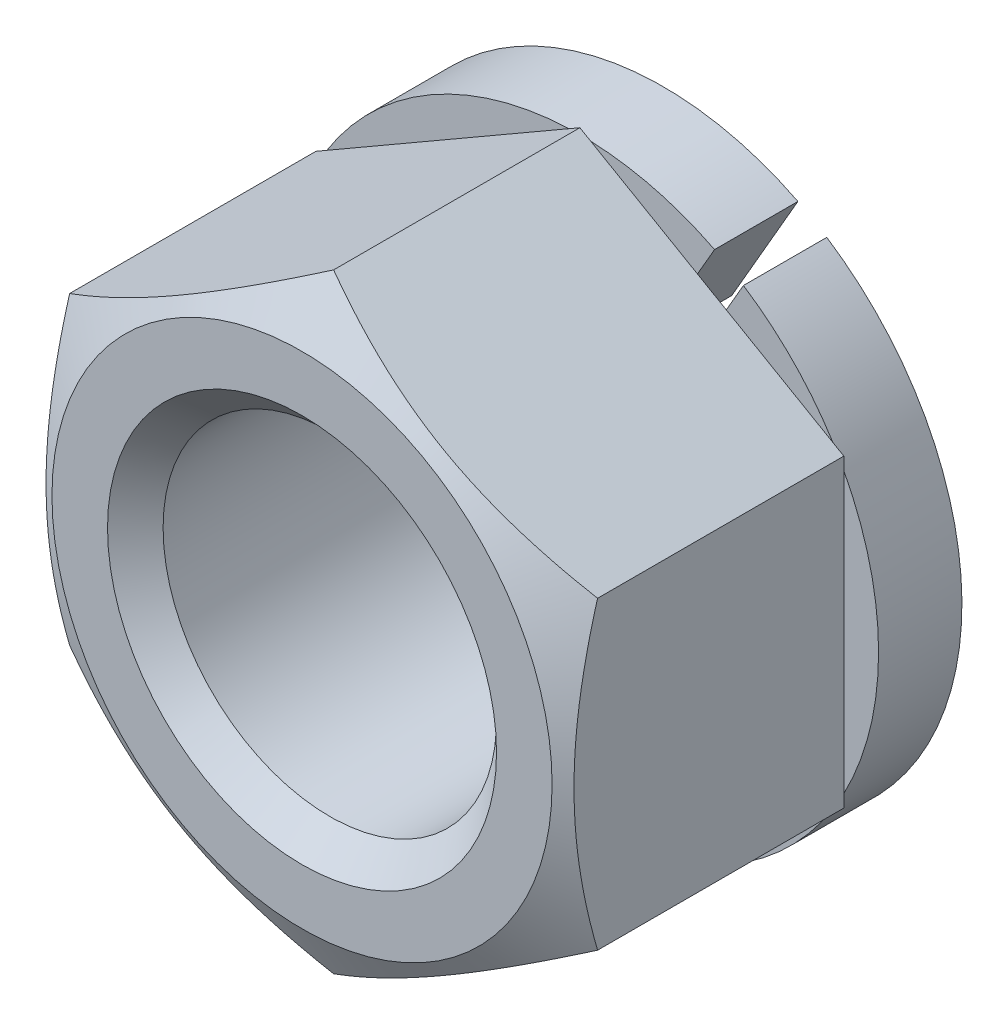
ISO-10303-21;
HEADER;
FILE_DESCRIPTION(('STEP AP214'),'2;1');
FILE_NAME('part.step','',(''),(''),'','','');
FILE_SCHEMA(('AUTOMOTIVE_DESIGN { 1 0 10303 214 1 1 1 1 }'));
ENDSEC;
DATA;
#1=APPLICATION_CONTEXT('core data for automotive mechanical design processes');
#2=APPLICATION_PROTOCOL_DEFINITION('international standard','automotive_design',2000,#1);
#3=PRODUCT_CONTEXT('',#1,'mechanical');
#4=PRODUCT('Part','Part','',(#3));
#5=PRODUCT_RELATED_PRODUCT_CATEGORY('part','',(#4));
#6=PRODUCT_DEFINITION_FORMATION('','',#4);
#7=PRODUCT_DEFINITION_CONTEXT('part definition',#1,'design');
#8=PRODUCT_DEFINITION('design','',#6,#7);
#9=PRODUCT_DEFINITION_SHAPE('','',#8);
#10=(LENGTH_UNIT() NAMED_UNIT(*) SI_UNIT(.MILLI.,.METRE.));
#11=(NAMED_UNIT(*) PLANE_ANGLE_UNIT() SI_UNIT($,.RADIAN.));
#12=(NAMED_UNIT(*) SI_UNIT($,.STERADIAN.) SOLID_ANGLE_UNIT());
#13=UNCERTAINTY_MEASURE_WITH_UNIT(LENGTH_MEASURE(1.E-05),#10,'distance_accuracy_value','');
#14=(GEOMETRIC_REPRESENTATION_CONTEXT(3) GLOBAL_UNCERTAINTY_ASSIGNED_CONTEXT((#13)) GLOBAL_UNIT_ASSIGNED_CONTEXT((#10,
#11,#12)) REPRESENTATION_CONTEXT('',''));
#15=CARTESIAN_POINT('',(0.,0.,0.));
#16=DIRECTION('',(0.,0.,1.));
#17=DIRECTION('',(1.,0.,0.));
#18=AXIS2_PLACEMENT_3D('',#15,#16,#17);
#19=CARTESIAN_POINT('',(0.,0.,0.));
#20=DIRECTION('',(0.,0.,-1.));
#21=DIRECTION('',(-1.,0.,0.));
#22=AXIS2_PLACEMENT_3D('',#19,#20,#21);
#23=PLANE('',#22);
#24=CARTESIAN_POINT('',(0.,0.,0.));
#25=DIRECTION('',(0.,0.,-1.));
#26=DIRECTION('',(-1.,0.,0.));
#27=AXIS2_PLACEMENT_3D('',#24,#25,#26);
#28=CIRCLE('',#27,10.75);
#29=CARTESIAN_POINT('',(5.88623661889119,8.9952608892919,0.));
#30=VERTEX_POINT('',#29);
#31=CARTESIAN_POINT('',(9.10710626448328,5.71166486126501,0.));
#32=VERTEX_POINT('',#31);
#33=EDGE_CURVE('E178',#30,#32,#28,.T.);
#34=ORIENTED_EDGE('',*,*,#33,.F.);
#35=DIRECTION('',(-0.5,-0.866025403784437,0.));
#36=VECTOR('',#35,1.);
#37=CARTESIAN_POINT('',(3.50457755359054,4.87010638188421,0.));
#38=LINE('',#37,#36);
#39=CARTESIAN_POINT('',(5.26961524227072,7.9272413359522,0.));
#40=VERTEX_POINT('',#39);
#41=EDGE_CURVE('E157',#30,#40,#38,.T.);
#42=ORIENTED_EDGE('',*,*,#41,.T.);
#43=DIRECTION('',(-0.866025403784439,0.5,0.));
#44=VECTOR('',#43,1.);
#45=CARTESIAN_POINT('',(9.5,5.48482755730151,0.));
#46=LINE('',#45,#44);
#47=EDGE_CURVE('E370',#32,#40,#46,.T.);
#48=ORIENTED_EDGE('',*,*,#47,.F.);
#49=EDGE_LOOP('',(#34,#42,#48));
#50=FACE_BOUND('',#49,.T.);
#51=ADVANCED_FACE('F14',(#50),#23,.F.);
#52=CARTESIAN_POINT('',(-19.,0.,0.));
#53=DIRECTION('',(0.,0.,-1.));
#54=DIRECTION('',(-1.,0.,0.));
#55=AXIS2_PLACEMENT_3D('',#52,#53,#54);
#56=PLANE('',#55);
#57=CARTESIAN_POINT('',(-9.5,5.03115294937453,0.));
#58=VERTEX_POINT('',#57);
#59=CARTESIAN_POINT('',(-9.10710626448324,5.71166486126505,0.));
#60=VERTEX_POINT('',#59);
#61=EDGE_CURVE('E174',#58,#60,#28,.T.);
#62=ORIENTED_EDGE('',*,*,#61,.F.);
#63=DIRECTION('',(0.,-1.,0.));
#64=VECTOR('',#63,1.);
#65=CARTESIAN_POINT('',(-9.5,5.48482755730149,0.));
#66=LINE('',#65,#64);
#67=CARTESIAN_POINT('',(-9.5,5.48482755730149,0.));
#68=VERTEX_POINT('',#67);
#69=EDGE_CURVE('E358',#68,#58,#66,.T.);
#70=ORIENTED_EDGE('',*,*,#69,.F.);
#71=DIRECTION('',(-0.866025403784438,-0.5,0.));
#72=VECTOR('',#71,1.);
#73=CARTESIAN_POINT('',(0.,10.969655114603,0.));
#74=LINE('',#73,#72);
#75=EDGE_CURVE('E367',#60,#68,#74,.T.);
#76=ORIENTED_EDGE('',*,*,#75,.F.);
#77=EDGE_LOOP('',(#62,#70,#76));
#78=FACE_BOUND('',#77,.T.);
#79=ADVANCED_FACE('F263',(#78),#56,.T.);
#80=CARTESIAN_POINT('',(-0.392893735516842,10.7428178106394,0.));
#81=VERTEX_POINT('',#80);
#82=CARTESIAN_POINT('',(0.392893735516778,10.7428178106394,0.));
#83=VERTEX_POINT('',#82);
#84=EDGE_CURVE('E326',#81,#83,#28,.T.);
#85=ORIENTED_EDGE('',*,*,#84,.F.);
#86=CARTESIAN_POINT('',(0.,10.969655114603,0.));
#87=VERTEX_POINT('',#86);
#88=EDGE_CURVE('E363',#87,#81,#74,.T.);
#89=ORIENTED_EDGE('',*,*,#88,.F.);
#90=EDGE_CURVE('E373',#83,#87,#46,.T.);
#91=ORIENTED_EDGE('',*,*,#90,.F.);
#92=EDGE_LOOP('',(#85,#89,#91));
#93=FACE_BOUND('',#92,.T.);
#94=ADVANCED_FACE('F273',(#93),#56,.T.);
#95=CARTESIAN_POINT('',(9.5,5.03115294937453,0.));
#96=VERTEX_POINT('',#95);
#97=EDGE_CURVE('E318',#32,#96,#28,.T.);
#98=ORIENTED_EDGE('',*,*,#97,.F.);
#99=CARTESIAN_POINT('',(9.5,5.48482755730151,0.));
#100=VERTEX_POINT('',#99);
#101=EDGE_CURVE('E368',#100,#32,#46,.T.);
#102=ORIENTED_EDGE('',*,*,#101,.F.);
#103=DIRECTION('',(0.,1.,0.));
#104=VECTOR('',#103,1.);
#105=CARTESIAN_POINT('',(9.5,-5.48482755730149,0.));
#106=LINE('',#105,#104);
#107=EDGE_CURVE('E311',#96,#100,#106,.T.);
#108=ORIENTED_EDGE('',*,*,#107,.F.);
#109=EDGE_LOOP('',(#98,#102,#108));
#110=FACE_BOUND('',#109,.T.);
#111=ADVANCED_FACE('F488',(#110),#56,.T.);
#112=CARTESIAN_POINT('',(9.5,-5.03115294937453,0.));
#113=VERTEX_POINT('',#112);
#114=CARTESIAN_POINT('',(9.10710626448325,-5.71166486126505,0.));
#115=VERTEX_POINT('',#114);
#116=EDGE_CURVE('E316',#113,#115,#28,.T.);
#117=ORIENTED_EDGE('',*,*,#116,.F.);
#118=CARTESIAN_POINT('',(9.5,-5.48482755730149,0.));
#119=VERTEX_POINT('',#118);
#120=EDGE_CURVE('E310',#119,#113,#106,.T.);
#121=ORIENTED_EDGE('',*,*,#120,.F.);
#122=DIRECTION('',(0.866025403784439,0.5,0.));
#123=VECTOR('',#122,1.);
#124=CARTESIAN_POINT('',(0.,-10.969655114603,0.));
#125=LINE('',#124,#123);
#126=EDGE_CURVE('E37',#115,#119,#125,.T.);
#127=ORIENTED_EDGE('',*,*,#126,.F.);
#128=EDGE_LOOP('',(#117,#121,#127));
#129=FACE_BOUND('',#128,.T.);
#130=ADVANCED_FACE('F495',(#129),#56,.T.);
#131=CARTESIAN_POINT('',(0.392893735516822,-10.7428178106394,0.));
#132=VERTEX_POINT('',#131);
#133=CARTESIAN_POINT('',(-0.392893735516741,-10.7428178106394,0.));
#134=VERTEX_POINT('',#133);
#135=EDGE_CURVE('E329',#132,#134,#28,.T.);
#136=ORIENTED_EDGE('',*,*,#135,.F.);
#137=CARTESIAN_POINT('',(0.,-10.969655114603,0.));
#138=VERTEX_POINT('',#137);
#139=EDGE_CURVE('E374',#138,#132,#125,.T.);
#140=ORIENTED_EDGE('',*,*,#139,.F.);
#141=DIRECTION('',(0.866025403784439,-0.5,0.));
#142=VECTOR('',#141,1.);
#143=CARTESIAN_POINT('',(-9.5,-5.48482755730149,0.));
#144=LINE('',#143,#142);
#145=EDGE_CURVE('E379',#134,#138,#144,.T.);
#146=ORIENTED_EDGE('',*,*,#145,.F.);
#147=EDGE_LOOP('',(#136,#140,#146));
#148=FACE_BOUND('',#147,.T.);
#149=ADVANCED_FACE('F264',(#148),#56,.T.);
#150=CARTESIAN_POINT('',(-19.,0.,10.));
#151=DIRECTION('',(0.,0.,-1.));
#152=DIRECTION('',(-1.,0.,0.));
#153=AXIS2_PLACEMENT_3D('',#150,#151,#152);
#154=PLANE('',#153);
#155=CARTESIAN_POINT('',(0.,0.,10.));
#156=DIRECTION('',(0.,0.,-1.));
#157=DIRECTION('',(-1.,0.,0.));
#158=AXIS2_PLACEMENT_3D('',#155,#156,#157);
#159=CIRCLE('',#158,7.);
#160=CARTESIAN_POINT('',(-7.,0.,10.));
#161=VERTEX_POINT('',#160);
#162=EDGE_CURVE('E9',#161,#161,#159,.T.);
#163=ORIENTED_EDGE('',*,*,#162,.T.);
#164=EDGE_LOOP('',(#163));
#165=FACE_BOUND('',#164,.T.);
#166=CARTESIAN_POINT('',(0.,0.,10.));
#167=DIRECTION('',(0.,0.,-1.));
#168=DIRECTION('',(-1.,0.,0.));
#169=AXIS2_PLACEMENT_3D('',#166,#167,#168);
#170=CIRCLE('',#169,9.);
#171=CARTESIAN_POINT('',(-9.,0.,10.));
#172=VERTEX_POINT('',#171);
#173=EDGE_CURVE('E173',#172,#172,#170,.T.);
#174=ORIENTED_EDGE('',*,*,#173,.F.);
#175=EDGE_LOOP('',(#174));
#176=FACE_BOUND('',#175,.T.);
#177=ADVANCED_FACE('F260',(#165,#176),#154,.F.);
#178=CARTESIAN_POINT('',(-9.1071062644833,-5.71166486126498,0.));
#179=VERTEX_POINT('',#178);
#180=CARTESIAN_POINT('',(-9.5,-5.03115294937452,0.));
#181=VERTEX_POINT('',#180);
#182=EDGE_CURVE('E179',#179,#181,#28,.T.);
#183=ORIENTED_EDGE('',*,*,#182,.F.);
#184=CARTESIAN_POINT('',(-9.5,-5.48482755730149,0.));
#185=VERTEX_POINT('',#184);
#186=EDGE_CURVE('E376',#185,#179,#144,.T.);
#187=ORIENTED_EDGE('',*,*,#186,.F.);
#188=EDGE_CURVE('E362',#181,#185,#66,.T.);
#189=ORIENTED_EDGE('',*,*,#188,.F.);
#190=EDGE_LOOP('',(#183,#187,#189));
#191=FACE_BOUND('',#190,.T.);
#192=ADVANCED_FACE('F253',(#191),#56,.T.);
#193=CARTESIAN_POINT('',(-9.5,-5.48482755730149,10.));
#194=DIRECTION('',(0.5,0.866025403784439,0.));
#195=DIRECTION('',(-0.866025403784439,0.5,0.));
#196=AXIS2_PLACEMENT_3D('',#193,#194,#195);
#197=PLANE('',#196);
#198=DIRECTION('',(0.,0.,-1.));
#199=VECTOR('',#198,1.);
#200=CARTESIAN_POINT('',(0.,-10.969655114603,10.));
#201=LINE('',#200,#199);
#202=CARTESIAN_POINT('',(0.,-10.969655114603,8.86281908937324));
#203=VERTEX_POINT('',#202);
#204=EDGE_CURVE('E335',#203,#138,#201,.T.);
#205=ORIENTED_EDGE('',*,*,#204,.F.);
#206=CARTESIAN_POINT('',(0.000199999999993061,-10.9697705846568,8.86275242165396));
#207=CARTESIAN_POINT('',(-0.208630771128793,-10.8492020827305,8.93235142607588));
#208=CARTESIAN_POINT('',(-0.418240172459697,-10.7281840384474,8.99879155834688));
#209=CARTESIAN_POINT('',(-0.839139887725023,-10.4851774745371,9.12447758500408));
#210=CARTESIAN_POINT('',(-1.05043073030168,-10.3631886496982,9.18372111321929));
#211=CARTESIAN_POINT('',(-1.68770779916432,-9.99525656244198,9.34951029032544));
#212=CARTESIAN_POINT('',(-2.11620976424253,-9.7478608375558,9.44381042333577));
#213=CARTESIAN_POINT('',(-2.75744333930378,-9.37764446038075,9.55438616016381));
#214=CARTESIAN_POINT('',(-2.9682592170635,-9.25592985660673,9.5858850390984));
#215=CARTESIAN_POINT('',(-3.39086703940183,-9.01193711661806,9.63870666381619));
#216=CARTESIAN_POINT('',(-3.60265900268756,-8.88965896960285,9.66002921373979));
#217=CARTESIAN_POINT('',(-4.02659621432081,-8.64489870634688,9.69195184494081));
#218=CARTESIAN_POINT('',(-4.23874074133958,-8.52241700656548,9.70256466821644));
#219=CARTESIAN_POINT('',(-4.66322575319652,-8.27734047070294,9.71284233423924));
#220=CARTESIAN_POINT('',(-4.8755662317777,-8.15474563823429,9.71250751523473));
#221=CARTESIAN_POINT('',(-5.27254199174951,-7.9255515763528,9.70165149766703));
#222=CARTESIAN_POINT('',(-5.45720529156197,-7.81893617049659,9.69245459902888));
#223=CARTESIAN_POINT('',(-5.82610000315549,-7.60595470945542,9.66595946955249));
#224=CARTESIAN_POINT('',(-6.01033138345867,-7.49958867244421,9.64866066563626));
#225=CARTESIAN_POINT('',(-6.56231167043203,-7.18090270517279,9.58502038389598));
#226=CARTESIAN_POINT('',(-6.92908353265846,-6.96914687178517,9.52694296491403));
#227=CARTESIAN_POINT('',(-7.66651782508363,-6.54338898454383,9.38174885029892));
#228=CARTESIAN_POINT('',(-8.03708614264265,-6.32944126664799,9.29401669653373));
#229=CARTESIAN_POINT('',(-8.77269671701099,-5.90473630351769,9.09490112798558));
#230=CARTESIAN_POINT('',(-9.13774839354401,-5.69397361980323,8.98356447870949));
#231=CARTESIAN_POINT('',(-9.5002,-5.48471208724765,8.86275242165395));
#232=B_SPLINE_CURVE_WITH_KNOTS('',3,(#206,#207,#208,#209,#210,#211,#212,#213,#214,#215,#216,
#217,#218,#219,#220,#221,#222,#223,#224,#225,#226,#227,#228,#229,#230,#231),.UNSPECIFIED.,.F.,
.F.,(4,2,2,2,2,2,2,2,2,2,2,2,4),(0.,0.752880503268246,1.50600787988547,3.01546870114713,
3.75167336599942,4.4878921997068,5.22323407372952,5.95855322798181,6.59868084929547,
7.23885375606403,8.52010929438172,9.82978009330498,11.1368800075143),.UNSPECIFIED.);
#233=CARTESIAN_POINT('',(-9.5,-5.48482755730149,8.86281908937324));
#234=VERTEX_POINT('',#233);
#235=EDGE_CURVE('E238',#203,#234,#232,.T.);
#236=ORIENTED_EDGE('',*,*,#235,.T.);
#237=DIRECTION('',(0.,0.,-1.));
#238=VECTOR('',#237,1.);
#239=CARTESIAN_POINT('',(-9.5,-5.48482755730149,10.));
#240=LINE('',#239,#238);
#241=EDGE_CURVE('E355',#234,#185,#240,.T.);
#242=ORIENTED_EDGE('',*,*,#241,.T.);
#243=ORIENTED_EDGE('',*,*,#186,.T.);
#244=EDGE_CURVE('E378',#179,#134,#144,.T.);
#245=ORIENTED_EDGE('',*,*,#244,.T.);
#246=ORIENTED_EDGE('',*,*,#145,.T.);
#247=EDGE_LOOP('',(#205,#236,#242,#243,#245,#246));
#248=FACE_BOUND('',#247,.T.);
#249=ADVANCED_FACE('F248',(#248),#197,.F.);
#250=CARTESIAN_POINT('',(0.,-10.969655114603,10.));
#251=DIRECTION('',(-0.5,0.866025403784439,0.));
#252=DIRECTION('',(-0.866025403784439,-0.5,0.));
#253=AXIS2_PLACEMENT_3D('',#250,#251,#252);
#254=PLANE('',#253);
#255=DIRECTION('',(0.,0.,-1.));
#256=VECTOR('',#255,1.);
#257=CARTESIAN_POINT('',(9.5,-5.48482755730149,10.));
#258=LINE('',#257,#256);
#259=CARTESIAN_POINT('',(9.5,-5.48482755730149,8.86281908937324));
#260=VERTEX_POINT('',#259);
#261=EDGE_CURVE('E341',#260,#119,#258,.T.);
#262=ORIENTED_EDGE('',*,*,#261,.F.);
#263=CARTESIAN_POINT('',(9.5002,-5.48471208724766,8.86275242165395));
#264=CARTESIAN_POINT('',(9.29136922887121,-5.60528058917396,8.93235142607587));
#265=CARTESIAN_POINT('',(9.08175982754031,-5.72629863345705,8.99879155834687));
#266=CARTESIAN_POINT('',(8.66086011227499,-5.96930519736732,9.12447758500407));
#267=CARTESIAN_POINT('',(8.44956926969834,-6.09129402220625,9.18372111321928));
#268=CARTESIAN_POINT('',(7.8122922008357,-6.45922610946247,9.34951029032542));
#269=CARTESIAN_POINT('',(7.3837902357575,-6.70662183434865,9.44381042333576));
#270=CARTESIAN_POINT('',(6.74255666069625,-7.07683821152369,9.5543861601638));
#271=CARTESIAN_POINT('',(6.53174078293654,-7.19855281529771,9.58588503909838));
#272=CARTESIAN_POINT('',(6.10913296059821,-7.44254555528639,9.63870666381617));
#273=CARTESIAN_POINT('',(5.89734099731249,-7.5648237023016,9.66002921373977));
#274=CARTESIAN_POINT('',(5.47340378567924,-7.80958396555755,9.69195184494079));
#275=CARTESIAN_POINT('',(5.26125925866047,-7.93206566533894,9.70256466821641));
#276=CARTESIAN_POINT('',(4.83677424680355,-8.1771422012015,9.71284233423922));
#277=CARTESIAN_POINT('',(4.62443376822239,-8.29973703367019,9.71250751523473));
#278=CARTESIAN_POINT('',(4.22745800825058,-8.52893109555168,9.70165149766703));
#279=CARTESIAN_POINT('',(4.04279470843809,-8.63554650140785,9.69245459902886));
#280=CARTESIAN_POINT('',(3.67389999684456,-8.848527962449,9.66595946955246));
#281=CARTESIAN_POINT('',(3.48966861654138,-8.95489399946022,9.64866066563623));
#282=CARTESIAN_POINT('',(2.93768832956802,-9.27357996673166,9.58502038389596));
#283=CARTESIAN_POINT('',(2.57091646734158,-9.48533580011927,9.52694296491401));
#284=CARTESIAN_POINT('',(1.8334821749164,-9.91109368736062,9.38174885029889));
#285=CARTESIAN_POINT('',(1.46291385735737,-10.1250414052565,9.2940166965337));
#286=CARTESIAN_POINT('',(0.72730328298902,-10.5497463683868,9.09490112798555));
#287=CARTESIAN_POINT('',(0.362251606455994,-10.7605090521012,8.98356447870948));
#288=CARTESIAN_POINT('',(-0.00020000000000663,-10.9697705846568,8.86275242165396));
#289=B_SPLINE_CURVE_WITH_KNOTS('',3,(#263,#264,#265,#266,#267,#268,#269,#270,#271,#272,#273,
#274,#275,#276,#277,#278,#279,#280,#281,#282,#283,#284,#285,#286,#287,#288),.UNSPECIFIED.,.F.,
.F.,(4,2,2,2,2,2,2,2,2,2,2,2,4),(0.,0.752880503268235,1.50600787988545,3.0154687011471,
3.75167336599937,4.48789219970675,5.22323407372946,5.95855322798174,6.5986808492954,
7.23885375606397,8.52010929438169,9.82978009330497,11.1368800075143),.UNSPECIFIED.);
#290=EDGE_CURVE('E231',#260,#203,#289,.T.);
#291=ORIENTED_EDGE('',*,*,#290,.T.);
#292=ORIENTED_EDGE('',*,*,#204,.T.);
#293=ORIENTED_EDGE('',*,*,#139,.T.);
#294=EDGE_CURVE('E375',#132,#115,#125,.T.);
#295=ORIENTED_EDGE('',*,*,#294,.T.);
#296=ORIENTED_EDGE('',*,*,#126,.T.);
#297=EDGE_LOOP('',(#262,#291,#292,#293,#295,#296));
#298=FACE_BOUND('',#297,.T.);
#299=ADVANCED_FACE('F244',(#298),#254,.F.);
#300=CARTESIAN_POINT('',(9.5,-5.48482755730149,10.));
#301=DIRECTION('',(-1.,0.,0.));
#302=DIRECTION('',(0.,0.,1.));
#303=AXIS2_PLACEMENT_3D('',#300,#301,#302);
#304=PLANE('',#303);
#305=DIRECTION('',(0.,0.,-1.));
#306=VECTOR('',#305,1.);
#307=CARTESIAN_POINT('',(9.5,5.48482755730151,10.));
#308=LINE('',#307,#306);
#309=CARTESIAN_POINT('',(9.5,5.48482755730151,8.86281908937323));
#310=VERTEX_POINT('',#309);
#311=EDGE_CURVE('E345',#310,#100,#308,.T.);
#312=ORIENTED_EDGE('',*,*,#311,.F.);
#313=CARTESIAN_POINT('',(9.5,-14.6148367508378,5.13229873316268));
#314=CARTESIAN_POINT('',(9.5,-14.4078646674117,5.23248573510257));
#315=CARTESIAN_POINT('',(9.5,-14.2006464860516,5.33216409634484));
#316=CARTESIAN_POINT('',(9.5,-13.7856665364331,5.53038809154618));
#317=CARTESIAN_POINT('',(9.5,-13.5779047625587,5.62893371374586));
#318=CARTESIAN_POINT('',(9.5,-12.9536699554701,5.92272506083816));
#319=CARTESIAN_POINT('',(9.5,-12.5363105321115,6.11609463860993));
#320=CARTESIAN_POINT('',(9.5,-11.6964302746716,6.49770516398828));
#321=CARTESIAN_POINT('',(9.5,-11.2738936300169,6.68591140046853));
#322=CARTESIAN_POINT('',(9.5,-10.4254186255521,7.05446510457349));
#323=CARTESIAN_POINT('',(9.5,-9.99948043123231,7.23481295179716));
#324=CARTESIAN_POINT('',(9.5,-9.13025376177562,7.5910039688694));
#325=CARTESIAN_POINT('',(9.5,-8.68683650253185,7.76653461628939));
#326=CARTESIAN_POINT('',(9.5,-7.79477203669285,8.1040230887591));
#327=CARTESIAN_POINT('',(9.5,-7.34612424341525,8.26597937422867));
#328=CARTESIAN_POINT('',(9.5,-6.44375804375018,8.57197988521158));
#329=CARTESIAN_POINT('',(9.5,-5.99005242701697,8.71606141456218));
#330=CARTESIAN_POINT('',(9.5,-5.0761514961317,8.9816137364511));
#331=CARTESIAN_POINT('',(9.5,-4.61595831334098,9.10309177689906));
#332=CARTESIAN_POINT('',(9.5,-3.69126680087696,9.31688415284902));
#333=CARTESIAN_POINT('',(9.5,-3.22680487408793,9.40935163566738));
#334=CARTESIAN_POINT('',(9.5,-2.52597866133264,9.52223165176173));
#335=CARTESIAN_POINT('',(9.5,-2.29166293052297,9.55555635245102));
#336=CARTESIAN_POINT('',(9.5,-1.82190740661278,9.61294252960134));
#337=CARTESIAN_POINT('',(9.5,-1.58646772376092,9.63700489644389));
#338=CARTESIAN_POINT('',(9.5,-1.11780333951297,9.67509126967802));
#339=CARTESIAN_POINT('',(9.5,-0.88458878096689,9.68923962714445));
#340=CARTESIAN_POINT('',(9.5,-0.417770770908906,9.70767011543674));
#341=CARTESIAN_POINT('',(9.5,-0.184167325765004,9.71195240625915));
#342=CARTESIAN_POINT('',(9.5,0.283012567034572,9.71054887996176));
#343=CARTESIAN_POINT('',(9.5,0.516589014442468,9.70486297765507));
#344=CARTESIAN_POINT('',(9.5,0.983298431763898,9.68365975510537));
#345=CARTESIAN_POINT('',(9.5,1.21643137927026,9.66814195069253));
#346=CARTESIAN_POINT('',(9.5,1.7803409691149,9.61904041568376));
#347=CARTESIAN_POINT('',(9.5,2.11070112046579,9.58059110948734));
#348=CARTESIAN_POINT('',(9.5,2.76889307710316,9.48607262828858));
#349=CARTESIAN_POINT('',(9.5,3.09672451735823,9.43000095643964));
#350=CARTESIAN_POINT('',(9.5,3.74957265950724,9.30223263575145));
#351=CARTESIAN_POINT('',(9.5,4.07458688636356,9.23052346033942));
#352=CARTESIAN_POINT('',(9.5,4.72131812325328,9.07366125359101));
#353=CARTESIAN_POINT('',(9.5,5.04303519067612,8.98850845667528));
#354=CARTESIAN_POINT('',(9.5,5.69019022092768,8.80482698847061));
#355=CARTESIAN_POINT('',(9.5,6.015556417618,8.70604720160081));
#356=CARTESIAN_POINT('',(9.5,6.66308248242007,8.49853754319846));
#357=CARTESIAN_POINT('',(9.5,6.98524232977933,8.38980760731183));
#358=CARTESIAN_POINT('',(9.5,7.62651950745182,8.16410157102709));
#359=CARTESIAN_POINT('',(9.5,7.94563786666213,8.04712838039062));
#360=CARTESIAN_POINT('',(9.5,8.58124736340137,7.80628683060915));
#361=CARTESIAN_POINT('',(9.5,8.89773852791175,7.68241854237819));
#362=CARTESIAN_POINT('',(9.5,9.62876672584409,7.38859225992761));
#363=CARTESIAN_POINT('',(9.5,10.0424495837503,7.21651263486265));
#364=CARTESIAN_POINT('',(9.5,10.8664391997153,6.8644298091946));
#365=CARTESIAN_POINT('',(9.5,11.2767457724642,6.68442617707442));
#366=CARTESIAN_POINT('',(9.5,12.0945919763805,6.31804036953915));
#367=CARTESIAN_POINT('',(9.5,12.5021310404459,6.1316569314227));
#368=CARTESIAN_POINT('',(9.5,13.3148099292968,5.75376233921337));
#369=CARTESIAN_POINT('',(9.5,13.7199497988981,5.5622512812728));
#370=CARTESIAN_POINT('',(9.5,14.5286246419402,5.17484256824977));
#371=CARTESIAN_POINT('',(9.5,14.9321575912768,4.97894069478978));
#372=CARTESIAN_POINT('',(9.5,15.7375188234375,4.58366538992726));
#373=CARTESIAN_POINT('',(9.5,16.1393470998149,4.38429194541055));
#374=CARTESIAN_POINT('',(9.5,17.3425803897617,3.78191090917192));
#375=CARTESIAN_POINT('',(9.5,18.14182917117,3.37459659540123));
#376=CARTESIAN_POINT('',(9.5,19.6719598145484,2.58493178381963));
#377=CARTESIAN_POINT('',(9.5,20.4031675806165,2.20321005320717));
#378=CARTESIAN_POINT('',(9.5,21.8628625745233,1.43454810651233));
#379=CARTESIAN_POINT('',(9.5,22.5913497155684,1.04760772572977));
#380=CARTESIAN_POINT('',(9.5,24.0445088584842,0.270634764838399));
#381=CARTESIAN_POINT('',(9.5,24.7691857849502,-0.119388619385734));
#382=CARTESIAN_POINT('',(9.5,26.2167909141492,-0.90258046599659));
#383=CARTESIAN_POINT('',(9.5,26.9397192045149,-1.29574876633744));
#384=CARTESIAN_POINT('',(9.5,27.6619992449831,-1.69009644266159));
#385=B_SPLINE_CURVE_WITH_KNOTS('',3,(#313,#314,#315,#316,#317,#318,#319,#320,#321,#322,#323,
#324,#325,#326,#327,#328,#329,#330,#331,#332,#333,#334,#335,#336,#337,#338,#339,#340,#341,#342,
#343,#344,#345,#346,#347,#348,#349,#350,#351,#352,#353,#354,#355,#356,#357,#358,#359,#360,#361,
#362,#363,#364,#365,#366,#367,#368,#369,#370,#371,#372,#373,#374,#375,#376,#377,#378,#379,#380,
#381,#382,#383,#384),.UNSPECIFIED.,.F.,.F.,(4,2,2,2,2,2,2,2,2,2,2,2,2,2,2,2,2,2,2,2,2,2,2,2,2,2,
2,2,2,2,2,2,2,2,2,4),(0.,0.68983486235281,1.37967687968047,2.75957131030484,4.14717928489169,
5.53472015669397,6.96523614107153,8.39591415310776,9.82355429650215,11.2507358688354,
12.6702513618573,13.3801178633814,14.089916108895,14.790643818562,15.4913601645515,
16.1920824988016,16.8928393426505,17.8900552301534,18.8874124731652,19.8855716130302,
20.8837133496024,21.9036134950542,22.9235202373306,23.9430687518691,24.9626067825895,
26.3066332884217,27.6507330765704,28.9951004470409,30.3394426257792,31.6851369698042,
33.0308363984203,35.7219177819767,38.1964429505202,40.6710463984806,43.1399395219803,
45.6087062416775),.UNSPECIFIED.);
#386=EDGE_CURVE('E224',#310,#260,#385,.F.);
#387=ORIENTED_EDGE('',*,*,#386,.T.);
#388=ORIENTED_EDGE('',*,*,#261,.T.);
#389=ORIENTED_EDGE('',*,*,#120,.T.);
#390=EDGE_CURVE('E304',#113,#96,#106,.T.);
#391=ORIENTED_EDGE('',*,*,#390,.T.);
#392=ORIENTED_EDGE('',*,*,#107,.T.);
#393=EDGE_LOOP('',(#312,#387,#388,#389,#391,#392));
#394=FACE_BOUND('',#393,.T.);
#395=ADVANCED_FACE('F247',(#394),#304,.F.);
#396=CARTESIAN_POINT('',(9.5,5.48482755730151,10.));
#397=DIRECTION('',(-0.5,-0.866025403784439,0.));
#398=DIRECTION('',(0.866025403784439,-0.5,0.));
#399=AXIS2_PLACEMENT_3D('',#396,#397,#398);
#400=PLANE('',#399);
#401=DIRECTION('',(0.,0.,-1.));
#402=VECTOR('',#401,1.);
#403=CARTESIAN_POINT('',(0.,10.969655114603,10.));
#404=LINE('',#403,#402);
#405=CARTESIAN_POINT('',(0.,10.969655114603,8.86281908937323));
#406=VERTEX_POINT('',#405);
#407=EDGE_CURVE('E350',#406,#87,#404,.T.);
#408=ORIENTED_EDGE('',*,*,#407,.F.);
#409=CARTESIAN_POINT('',(-0.000199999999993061,10.9697705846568,8.86275242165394));
#410=CARTESIAN_POINT('',(0.208630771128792,10.8492020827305,8.93235142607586));
#411=CARTESIAN_POINT('',(0.418240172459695,10.7281840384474,8.99879155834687));
#412=CARTESIAN_POINT('',(0.839139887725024,10.4851774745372,9.12447758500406));
#413=CARTESIAN_POINT('',(1.05043073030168,10.3631886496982,9.18372111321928));
#414=CARTESIAN_POINT('',(1.68770779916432,9.99525656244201,9.34951029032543));
#415=CARTESIAN_POINT('',(2.11620976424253,9.74786083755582,9.44381042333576));
#416=CARTESIAN_POINT('',(2.75744333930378,9.37764446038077,9.5543861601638));
#417=CARTESIAN_POINT('',(2.9682592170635,9.25592985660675,9.58588503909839));
#418=CARTESIAN_POINT('',(3.39086703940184,9.01193711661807,9.63870666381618));
#419=CARTESIAN_POINT('',(3.60265900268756,8.88965896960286,9.66002921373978));
#420=CARTESIAN_POINT('',(4.02659621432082,8.6448987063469,9.6919518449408));
#421=CARTESIAN_POINT('',(4.23874074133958,8.5224170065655,9.70256466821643));
#422=CARTESIAN_POINT('',(4.66322575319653,8.27734047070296,9.71284233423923));
#423=CARTESIAN_POINT('',(4.8755662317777,8.1547456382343,9.71250751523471));
#424=CARTESIAN_POINT('',(5.27254199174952,7.92555157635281,9.70165149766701));
#425=CARTESIAN_POINT('',(5.45720529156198,7.81893617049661,9.69245459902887));
#426=CARTESIAN_POINT('',(5.8261000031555,7.60595470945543,9.66595946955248));
#427=CARTESIAN_POINT('',(6.01033138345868,7.49958867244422,9.64866066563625));
#428=CARTESIAN_POINT('',(6.56231167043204,7.1809027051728,9.58502038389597));
#429=CARTESIAN_POINT('',(6.92908353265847,6.96914687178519,9.52694296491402));
#430=CARTESIAN_POINT('',(7.66651782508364,6.54338898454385,9.38174885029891));
#431=CARTESIAN_POINT('',(8.03708614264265,6.32944126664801,9.29401669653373));
#432=CARTESIAN_POINT('',(8.77269671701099,5.90473630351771,9.09490112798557));
#433=CARTESIAN_POINT('',(9.13774839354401,5.69397361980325,8.98356447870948));
#434=CARTESIAN_POINT('',(9.5002,5.48471208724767,8.86275242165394));
#435=B_SPLINE_CURVE_WITH_KNOTS('',3,(#409,#410,#411,#412,#413,#414,#415,#416,#417,#418,#419,
#420,#421,#422,#423,#424,#425,#426,#427,#428,#429,#430,#431,#432,#433,#434),.UNSPECIFIED.,.F.,
.F.,(4,2,2,2,2,2,2,2,2,2,2,2,4),(0.,0.752880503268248,1.50600787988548,3.01546870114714,
3.75167336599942,4.48789219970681,5.22323407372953,5.95855322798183,6.59868084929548,
7.23885375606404,8.52010929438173,9.82978009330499,11.1368800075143),.UNSPECIFIED.);
#436=EDGE_CURVE('E191',#406,#310,#435,.T.);
#437=ORIENTED_EDGE('',*,*,#436,.T.);
#438=ORIENTED_EDGE('',*,*,#311,.T.);
#439=ORIENTED_EDGE('',*,*,#101,.T.);
#440=ORIENTED_EDGE('',*,*,#47,.T.);
#441=DIRECTION('',(0.866025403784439,-0.5,0.));
#442=VECTOR('',#441,1.);
#443=CARTESIAN_POINT('',(9.5,5.48482755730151,0.));
#444=LINE('',#443,#442);
#445=CARTESIAN_POINT('',(4.2303847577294,8.5272413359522,0.));
#446=VERTEX_POINT('',#445);
#447=EDGE_CURVE('E165',#446,#40,#444,.T.);
#448=ORIENTED_EDGE('',*,*,#447,.F.);
#449=EDGE_CURVE('E371',#446,#83,#46,.T.);
#450=ORIENTED_EDGE('',*,*,#449,.T.);
#451=ORIENTED_EDGE('',*,*,#90,.T.);
#452=EDGE_LOOP('',(#408,#437,#438,#439,#440,#448,#450,#451));
#453=FACE_BOUND('',#452,.T.);
#454=ADVANCED_FACE('F440',(#453),#400,.F.);
#455=CARTESIAN_POINT('',(0.,10.969655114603,10.));
#456=DIRECTION('',(0.5,-0.866025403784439,0.));
#457=DIRECTION('',(0.866025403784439,0.5,0.));
#458=AXIS2_PLACEMENT_3D('',#455,#456,#457);
#459=PLANE('',#458);
#460=DIRECTION('',(0.,0.,-1.));
#461=VECTOR('',#460,1.);
#462=CARTESIAN_POINT('',(-9.5,5.48482755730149,10.));
#463=LINE('',#462,#461);
#464=CARTESIAN_POINT('',(-9.5,5.48482755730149,8.86281908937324));
#465=VERTEX_POINT('',#464);
#466=EDGE_CURVE('E353',#465,#68,#463,.T.);
#467=ORIENTED_EDGE('',*,*,#466,.F.);
#468=CARTESIAN_POINT('',(-9.5002,5.48471208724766,8.86275242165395));
#469=CARTESIAN_POINT('',(-9.29136922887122,5.60528058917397,8.93235142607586));
#470=CARTESIAN_POINT('',(-9.08175982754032,5.72629863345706,8.99879155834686));
#471=CARTESIAN_POINT('',(-8.660860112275,5.96930519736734,9.12447758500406));
#472=CARTESIAN_POINT('',(-8.44956926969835,6.09129402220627,9.18372111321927));
#473=CARTESIAN_POINT('',(-7.81229220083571,6.45922610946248,9.34951029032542));
#474=CARTESIAN_POINT('',(-7.38379023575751,6.70662183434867,9.44381042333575));
#475=CARTESIAN_POINT('',(-6.74255666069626,7.07683821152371,9.55438616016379));
#476=CARTESIAN_POINT('',(-6.53174078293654,7.19855281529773,9.58588503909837));
#477=CARTESIAN_POINT('',(-6.10913296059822,7.4425455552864,9.63870666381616));
#478=CARTESIAN_POINT('',(-5.89734099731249,7.56482370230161,9.66002921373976));
#479=CARTESIAN_POINT('',(-5.47340378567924,7.80958396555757,9.69195184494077));
#480=CARTESIAN_POINT('',(-5.26125925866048,7.93206566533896,9.7025646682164));
#481=CARTESIAN_POINT('',(-4.83677424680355,8.17714220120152,9.71284233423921));
#482=CARTESIAN_POINT('',(-4.62443376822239,8.2997370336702,9.71250751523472));
#483=CARTESIAN_POINT('',(-4.22745800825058,8.52893109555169,9.70165149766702));
#484=CARTESIAN_POINT('',(-4.04279470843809,8.63554650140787,9.69245459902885));
#485=CARTESIAN_POINT('',(-3.67389999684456,8.84852796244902,9.66595946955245));
#486=CARTESIAN_POINT('',(-3.48966861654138,8.95489399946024,9.64866066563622));
#487=CARTESIAN_POINT('',(-2.93768832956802,9.27357996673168,9.58502038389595));
#488=CARTESIAN_POINT('',(-2.57091646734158,9.48533580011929,9.52694296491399));
#489=CARTESIAN_POINT('',(-1.8334821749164,9.91109368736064,9.38174885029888));
#490=CARTESIAN_POINT('',(-1.46291385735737,10.1250414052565,9.29401669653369));
#491=CARTESIAN_POINT('',(-0.72730328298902,10.5497463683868,9.09490112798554));
#492=CARTESIAN_POINT('',(-0.362251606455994,10.7605090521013,8.98356447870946));
#493=CARTESIAN_POINT('',(0.000200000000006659,10.9697705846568,8.86275242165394));
#494=B_SPLINE_CURVE_WITH_KNOTS('',3,(#468,#469,#470,#471,#472,#473,#474,#475,#476,#477,#478,
#479,#480,#481,#482,#483,#484,#485,#486,#487,#488,#489,#490,#491,#492,#493),.UNSPECIFIED.,.F.,
.F.,(4,2,2,2,2,2,2,2,2,2,2,2,4),(0.,0.752880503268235,1.50600787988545,3.0154687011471,
3.75167336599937,4.48789219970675,5.22323407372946,5.95855322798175,6.59868084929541,
7.23885375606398,8.52010929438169,9.82978009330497,11.1368800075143),.UNSPECIFIED.);
#495=EDGE_CURVE('E182',#465,#406,#494,.T.);
#496=ORIENTED_EDGE('',*,*,#495,.T.);
#497=ORIENTED_EDGE('',*,*,#407,.T.);
#498=ORIENTED_EDGE('',*,*,#88,.T.);
#499=EDGE_CURVE('E366',#81,#60,#74,.T.);
#500=ORIENTED_EDGE('',*,*,#499,.T.);
#501=ORIENTED_EDGE('',*,*,#75,.T.);
#502=EDGE_LOOP('',(#467,#496,#497,#498,#500,#501));
#503=FACE_BOUND('',#502,.T.);
#504=ADVANCED_FACE('F198',(#503),#459,.F.);
#505=CARTESIAN_POINT('',(-9.5,5.48482755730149,10.));
#506=DIRECTION('',(1.,0.,0.));
#507=DIRECTION('',(0.,1.,0.));
#508=AXIS2_PLACEMENT_3D('',#505,#506,#507);
#509=PLANE('',#508);
#510=ORIENTED_EDGE('',*,*,#241,.F.);
#511=CARTESIAN_POINT('',(-9.5,-14.6148367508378,5.13229873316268));
#512=CARTESIAN_POINT('',(-9.50000000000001,-14.4078646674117,5.23248573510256));
#513=CARTESIAN_POINT('',(-9.50000000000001,-14.2006464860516,5.33216409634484));
#514=CARTESIAN_POINT('',(-9.50000000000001,-13.7856665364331,5.53038809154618));
#515=CARTESIAN_POINT('',(-9.50000000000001,-13.5779047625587,5.62893371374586));
#516=CARTESIAN_POINT('',(-9.5,-12.9536699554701,5.92272506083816));
#517=CARTESIAN_POINT('',(-9.50000000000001,-12.5363105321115,6.11609463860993));
#518=CARTESIAN_POINT('',(-9.50000000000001,-11.6964302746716,6.49770516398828));
#519=CARTESIAN_POINT('',(-9.50000000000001,-11.2738936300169,6.68591140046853));
#520=CARTESIAN_POINT('',(-9.50000000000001,-10.4254186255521,7.05446510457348));
#521=CARTESIAN_POINT('',(-9.50000000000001,-9.99948043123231,7.23481295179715));
#522=CARTESIAN_POINT('',(-9.50000000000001,-9.13025376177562,7.5910039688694));
#523=CARTESIAN_POINT('',(-9.50000000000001,-8.68683650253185,7.76653461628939));
#524=CARTESIAN_POINT('',(-9.50000000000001,-7.79477203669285,8.10402308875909));
#525=CARTESIAN_POINT('',(-9.5,-7.34612424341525,8.26597937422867));
#526=CARTESIAN_POINT('',(-9.5,-6.44375804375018,8.57197988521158));
#527=CARTESIAN_POINT('',(-9.50000000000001,-5.99005242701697,8.71606141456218));
#528=CARTESIAN_POINT('',(-9.5,-5.0761514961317,8.9816137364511));
#529=CARTESIAN_POINT('',(-9.5,-4.61595831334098,9.10309177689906));
#530=CARTESIAN_POINT('',(-9.5,-3.69126680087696,9.31688415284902));
#531=CARTESIAN_POINT('',(-9.5,-3.22680487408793,9.40935163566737));
#532=CARTESIAN_POINT('',(-9.5,-2.52597866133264,9.52223165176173));
#533=CARTESIAN_POINT('',(-9.5,-2.29166293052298,9.55555635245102));
#534=CARTESIAN_POINT('',(-9.5,-1.82190740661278,9.61294252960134));
#535=CARTESIAN_POINT('',(-9.5,-1.58646772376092,9.63700489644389));
#536=CARTESIAN_POINT('',(-9.5,-1.11780333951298,9.67509126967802));
#537=CARTESIAN_POINT('',(-9.5,-0.884588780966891,9.68923962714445));
#538=CARTESIAN_POINT('',(-9.5,-0.417770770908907,9.70767011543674));
#539=CARTESIAN_POINT('',(-9.5,-0.184167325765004,9.71195240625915));
#540=CARTESIAN_POINT('',(-9.5,0.283012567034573,9.71054887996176));
#541=CARTESIAN_POINT('',(-9.5,0.516589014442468,9.70486297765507));
#542=CARTESIAN_POINT('',(-9.5,0.983298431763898,9.68365975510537));
#543=CARTESIAN_POINT('',(-9.5,1.21643137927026,9.66814195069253));
#544=CARTESIAN_POINT('',(-9.5,1.7803409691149,9.61904041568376));
#545=CARTESIAN_POINT('',(-9.5,2.11070112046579,9.58059110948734));
#546=CARTESIAN_POINT('',(-9.5,2.76889307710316,9.48607262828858));
#547=CARTESIAN_POINT('',(-9.5,3.09672451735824,9.43000095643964));
#548=CARTESIAN_POINT('',(-9.5,3.74957265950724,9.30223263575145));
#549=CARTESIAN_POINT('',(-9.5,4.07458688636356,9.23052346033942));
#550=CARTESIAN_POINT('',(-9.5,4.72131812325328,9.07366125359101));
#551=CARTESIAN_POINT('',(-9.5,5.04303519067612,8.98850845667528));
#552=CARTESIAN_POINT('',(-9.5,5.69019022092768,8.80482698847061));
#553=CARTESIAN_POINT('',(-9.5,6.015556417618,8.70604720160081));
#554=CARTESIAN_POINT('',(-9.5,6.66308248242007,8.49853754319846));
#555=CARTESIAN_POINT('',(-9.5,6.98524232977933,8.38980760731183));
#556=CARTESIAN_POINT('',(-9.5,7.62651950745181,8.16410157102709));
#557=CARTESIAN_POINT('',(-9.5,7.94563786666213,8.04712838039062));
#558=CARTESIAN_POINT('',(-9.5,8.58124736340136,7.80628683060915));
#559=CARTESIAN_POINT('',(-9.5,8.89773852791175,7.68241854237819));
#560=CARTESIAN_POINT('',(-9.5,9.62876672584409,7.38859225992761));
#561=CARTESIAN_POINT('',(-9.5,10.0424495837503,7.21651263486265));
#562=CARTESIAN_POINT('',(-9.5,10.8664391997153,6.8644298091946));
#563=CARTESIAN_POINT('',(-9.5,11.2767457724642,6.68442617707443));
#564=CARTESIAN_POINT('',(-9.5,12.0945919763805,6.31804036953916));
#565=CARTESIAN_POINT('',(-9.5,12.5021310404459,6.13165693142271));
#566=CARTESIAN_POINT('',(-9.5,13.3148099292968,5.75376233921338));
#567=CARTESIAN_POINT('',(-9.5,13.7199497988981,5.56225128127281));
#568=CARTESIAN_POINT('',(-9.5,14.5286246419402,5.17484256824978));
#569=CARTESIAN_POINT('',(-9.5,14.9321575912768,4.97894069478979));
#570=CARTESIAN_POINT('',(-9.5,15.7375188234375,4.58366538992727));
#571=CARTESIAN_POINT('',(-9.5,16.1393470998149,4.38429194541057));
#572=CARTESIAN_POINT('',(-9.5,17.3425803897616,3.78191090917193));
#573=CARTESIAN_POINT('',(-9.5,18.14182917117,3.37459659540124));
#574=CARTESIAN_POINT('',(-9.5,19.6719598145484,2.58493178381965));
#575=CARTESIAN_POINT('',(-9.49999999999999,20.4031675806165,2.20321005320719));
#576=CARTESIAN_POINT('',(-9.49999999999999,21.8628625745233,1.43454810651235));
#577=CARTESIAN_POINT('',(-9.49999999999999,22.5913497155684,1.04760772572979));
#578=CARTESIAN_POINT('',(-9.49999999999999,24.0445088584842,0.270634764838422));
#579=CARTESIAN_POINT('',(-9.49999999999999,24.7691857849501,-0.119388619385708));
#580=CARTESIAN_POINT('',(-9.49999999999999,26.2167909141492,-0.902580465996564));
#581=CARTESIAN_POINT('',(-9.49999999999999,26.9397192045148,-1.29574876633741));
#582=CARTESIAN_POINT('',(-9.5,27.661999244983,-1.69009644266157));
#583=B_SPLINE_CURVE_WITH_KNOTS('',3,(#511,#512,#513,#514,#515,#516,#517,#518,#519,#520,#521,
#522,#523,#524,#525,#526,#527,#528,#529,#530,#531,#532,#533,#534,#535,#536,#537,#538,#539,#540,
#541,#542,#543,#544,#545,#546,#547,#548,#549,#550,#551,#552,#553,#554,#555,#556,#557,#558,#559,
#560,#561,#562,#563,#564,#565,#566,#567,#568,#569,#570,#571,#572,#573,#574,#575,#576,#577,#578,
#579,#580,#581,#582),.UNSPECIFIED.,.F.,.F.,(4,2,2,2,2,2,2,2,2,2,2,2,2,2,2,2,2,2,2,2,2,2,2,2,2,2,
2,2,2,2,2,2,2,2,2,4),(0.,0.689834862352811,1.37967687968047,2.75957131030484,4.14717928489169,
5.53472015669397,6.96523614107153,8.39591415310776,9.82355429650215,11.2507358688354,
12.6702513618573,13.3801178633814,14.089916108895,14.790643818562,15.4913601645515,
16.1920824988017,16.8928393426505,17.8900552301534,18.8874124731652,19.8855716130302,
20.8837133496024,21.9036134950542,22.9235202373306,23.9430687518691,24.9626067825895,
26.3066332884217,27.6507330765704,28.9951004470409,30.3394426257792,31.6851369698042,
33.0308363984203,35.7219177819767,38.1964429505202,40.6710463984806,43.1399395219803,
45.6087062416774),.UNSPECIFIED.);
#584=EDGE_CURVE('E214',#234,#465,#583,.T.);
#585=ORIENTED_EDGE('',*,*,#584,.T.);
#586=ORIENTED_EDGE('',*,*,#466,.T.);
#587=ORIENTED_EDGE('',*,*,#69,.T.);
#588=EDGE_CURVE('E361',#58,#181,#66,.T.);
#589=ORIENTED_EDGE('',*,*,#588,.T.);
#590=ORIENTED_EDGE('',*,*,#188,.T.);
#591=EDGE_LOOP('',(#510,#585,#586,#587,#589,#590));
#592=FACE_BOUND('',#591,.T.);
#593=ADVANCED_FACE('F385',(#592),#509,.F.);
#594=CARTESIAN_POINT('',(0.,0.,10.));
#595=DIRECTION('',(0.,0.,-1.));
#596=DIRECTION('',(-1.,0.,0.));
#597=AXIS2_PLACEMENT_3D('',#594,#595,#596);
#598=CYLINDRICAL_SURFACE('',#597,6.);
#599=DIRECTION('',(0.,0.,-1.));
#600=VECTOR('',#599,1.);
#601=CARTESIAN_POINT('',(3.50457755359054,4.87010638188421,0.));
#602=LINE('',#601,#600);
#603=CARTESIAN_POINT('',(3.50457755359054,4.87010638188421,0.));
#604=VERTEX_POINT('',#603);
#605=CARTESIAN_POINT('',(3.50457755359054,4.87010638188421,-3.));
#606=VERTEX_POINT('',#605);
#607=EDGE_CURVE('E167',#604,#606,#602,.T.);
#608=ORIENTED_EDGE('',*,*,#607,.T.);
#609=CARTESIAN_POINT('',(0.,0.,-3.));
#610=DIRECTION('',(0.,0.,-1.));
#611=DIRECTION('',(-1.,0.,0.));
#612=AXIS2_PLACEMENT_3D('',#609,#610,#611);
#613=CIRCLE('',#612,6.);
#614=CARTESIAN_POINT('',(2.46534706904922,5.47010638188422,-3.));
#615=VERTEX_POINT('',#614);
#616=EDGE_CURVE('E155',#606,#615,#613,.T.);
#617=ORIENTED_EDGE('',*,*,#616,.T.);
#618=DIRECTION('',(0.,0.,-1.));
#619=VECTOR('',#618,1.);
#620=CARTESIAN_POINT('',(2.46534706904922,5.47010638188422,0.));
#621=LINE('',#620,#619);
#622=CARTESIAN_POINT('',(2.46534706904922,5.47010638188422,0.));
#623=VERTEX_POINT('',#622);
#624=EDGE_CURVE('E135',#623,#615,#621,.T.);
#625=ORIENTED_EDGE('',*,*,#624,.F.);
#626=CARTESIAN_POINT('',(0.,0.,0.));
#627=DIRECTION('',(0.,0.,1.));
#628=DIRECTION('',(-1.,0.,0.));
#629=AXIS2_PLACEMENT_3D('',#626,#627,#628);
#630=CIRCLE('',#629,6.);
#631=EDGE_CURVE('E143',#604,#623,#630,.T.);
#632=ORIENTED_EDGE('',*,*,#631,.F.);
#633=EDGE_LOOP('',(#608,#617,#625,#632));
#634=FACE_BOUND('',#633,.T.);
#635=CARTESIAN_POINT('',(0.,0.,9.));
#636=DIRECTION('',(0.,0.,-1.));
#637=DIRECTION('',(-1.,0.,0.));
#638=AXIS2_PLACEMENT_3D('',#635,#636,#637);
#639=CIRCLE('',#638,6.);
#640=CARTESIAN_POINT('',(-6.,0.,9.));
#641=VERTEX_POINT('',#640);
#642=EDGE_CURVE('E22',#641,#641,#639,.F.);
#643=ORIENTED_EDGE('',*,*,#642,.T.);
#644=EDGE_LOOP('',(#643));
#645=FACE_BOUND('',#644,.T.);
#646=ADVANCED_FACE('F152',(#634,#645),#598,.F.);
#647=CARTESIAN_POINT('',(0.,0.,10.));
#648=DIRECTION('',(0.,0.,-1.));
#649=DIRECTION('',(-1.,0.,0.));
#650=AXIS2_PLACEMENT_3D('',#647,#648,#649);
#651=CONICAL_SURFACE('',#650,9.,1.0471975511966);
#652=ORIENTED_EDGE('',*,*,#173,.T.);
#653=EDGE_LOOP('',(#652));
#654=FACE_BOUND('',#653,.T.);
#655=ORIENTED_EDGE('',*,*,#290,.F.);
#656=ORIENTED_EDGE('',*,*,#386,.F.);
#657=ORIENTED_EDGE('',*,*,#436,.F.);
#658=ORIENTED_EDGE('',*,*,#495,.F.);
#659=ORIENTED_EDGE('',*,*,#584,.F.);
#660=ORIENTED_EDGE('',*,*,#235,.F.);
#661=EDGE_LOOP('',(#655,#656,#657,#658,#659,#660));
#662=FACE_BOUND('',#661,.T.);
#663=ADVANCED_FACE('F201',(#654,#662),#651,.T.);
#664=ORIENTED_EDGE('',*,*,#244,.F.);
#665=EDGE_CURVE('E321',#134,#179,#28,.T.);
#666=ORIENTED_EDGE('',*,*,#665,.F.);
#667=EDGE_LOOP('',(#664,#666));
#668=FACE_BOUND('',#667,.T.);
#669=ADVANCED_FACE('F206',(#668),#23,.F.);
#670=ORIENTED_EDGE('',*,*,#588,.F.);
#671=EDGE_CURVE('E169',#181,#58,#28,.T.);
#672=ORIENTED_EDGE('',*,*,#671,.F.);
#673=EDGE_LOOP('',(#670,#672));
#674=FACE_BOUND('',#673,.T.);
#675=ADVANCED_FACE('F278',(#674),#23,.F.);
#676=ORIENTED_EDGE('',*,*,#499,.F.);
#677=EDGE_CURVE('E177',#60,#81,#28,.T.);
#678=ORIENTED_EDGE('',*,*,#677,.F.);
#679=EDGE_LOOP('',(#676,#678));
#680=FACE_BOUND('',#679,.T.);
#681=ADVANCED_FACE('F299',(#680),#23,.F.);
#682=ORIENTED_EDGE('',*,*,#449,.F.);
#683=DIRECTION('',(0.5,0.866025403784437,0.));
#684=VECTOR('',#683,1.);
#685=CARTESIAN_POINT('',(2.46534706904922,5.47010638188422,0.));
#686=LINE('',#685,#684);
#687=CARTESIAN_POINT('',(4.84700613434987,9.5952608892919,0.));
#688=VERTEX_POINT('',#687);
#689=EDGE_CURVE('E137',#446,#688,#686,.T.);
#690=ORIENTED_EDGE('',*,*,#689,.T.);
#691=EDGE_CURVE('E320',#83,#688,#28,.T.);
#692=ORIENTED_EDGE('',*,*,#691,.F.);
#693=EDGE_LOOP('',(#682,#690,#692));
#694=FACE_BOUND('',#693,.T.);
#695=ADVANCED_FACE('F293',(#694),#23,.F.);
#696=ORIENTED_EDGE('',*,*,#390,.F.);
#697=EDGE_CURVE('E306',#96,#113,#28,.T.);
#698=ORIENTED_EDGE('',*,*,#697,.F.);
#699=EDGE_LOOP('',(#696,#698));
#700=FACE_BOUND('',#699,.T.);
#701=ADVANCED_FACE('F283',(#700),#23,.F.);
#702=CARTESIAN_POINT('',(0.,0.,-3.));
#703=DIRECTION('',(0.,0.,-1.));
#704=DIRECTION('',(-1.,0.,0.));
#705=AXIS2_PLACEMENT_3D('',#702,#703,#704);
#706=PLANE('',#705);
#707=DIRECTION('',(-0.5,-0.866025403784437,0.));
#708=VECTOR('',#707,1.);
#709=CARTESIAN_POINT('',(3.50457755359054,4.87010638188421,-3.));
#710=LINE('',#709,#708);
#711=CARTESIAN_POINT('',(5.88623661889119,8.9952608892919,-3.));
#712=VERTEX_POINT('',#711);
#713=EDGE_CURVE('E149',#712,#606,#710,.T.);
#714=ORIENTED_EDGE('',*,*,#713,.F.);
#715=CARTESIAN_POINT('',(0.,0.,-3.));
#716=DIRECTION('',(0.,0.,-1.));
#717=DIRECTION('',(-1.,0.,0.));
#718=AXIS2_PLACEMENT_3D('',#715,#716,#717);
#719=CIRCLE('',#718,10.75);
#720=CARTESIAN_POINT('',(4.84700613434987,9.5952608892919,-3.));
#721=VERTEX_POINT('',#720);
#722=EDGE_CURVE('E170',#712,#721,#719,.T.);
#723=ORIENTED_EDGE('',*,*,#722,.T.);
#724=DIRECTION('',(0.5,0.866025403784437,0.));
#725=VECTOR('',#724,1.);
#726=CARTESIAN_POINT('',(2.46534706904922,5.47010638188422,-3.));
#727=LINE('',#726,#725);
#728=EDGE_CURVE('E29',#615,#721,#727,.T.);
#729=ORIENTED_EDGE('',*,*,#728,.F.);
#730=ORIENTED_EDGE('',*,*,#616,.F.);
#731=EDGE_LOOP('',(#714,#723,#729,#730));
#732=FACE_BOUND('',#731,.T.);
#733=ADVANCED_FACE('F281',(#732),#706,.T.);
#734=ORIENTED_EDGE('',*,*,#294,.F.);
#735=EDGE_CURVE('E319',#115,#132,#28,.T.);
#736=ORIENTED_EDGE('',*,*,#735,.F.);
#737=EDGE_LOOP('',(#734,#736));
#738=FACE_BOUND('',#737,.T.);
#739=ADVANCED_FACE('F268',(#738),#23,.F.);
#740=CARTESIAN_POINT('',(0.,0.,-3.));
#741=DIRECTION('',(0.,0.,1.));
#742=DIRECTION('',(1.,0.,0.));
#743=AXIS2_PLACEMENT_3D('',#740,#741,#742);
#744=CYLINDRICAL_SURFACE('',#743,10.75);
#745=ORIENTED_EDGE('',*,*,#722,.F.);
#746=DIRECTION('',(0.,0.,-1.));
#747=VECTOR('',#746,1.);
#748=CARTESIAN_POINT('',(5.88623661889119,8.9952608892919,0.));
#749=LINE('',#748,#747);
#750=EDGE_CURVE('E159',#30,#712,#749,.T.);
#751=ORIENTED_EDGE('',*,*,#750,.F.);
#752=ORIENTED_EDGE('',*,*,#33,.T.);
#753=ORIENTED_EDGE('',*,*,#97,.T.);
#754=ORIENTED_EDGE('',*,*,#697,.T.);
#755=ORIENTED_EDGE('',*,*,#116,.T.);
#756=ORIENTED_EDGE('',*,*,#735,.T.);
#757=ORIENTED_EDGE('',*,*,#135,.T.);
#758=ORIENTED_EDGE('',*,*,#665,.T.);
#759=ORIENTED_EDGE('',*,*,#182,.T.);
#760=ORIENTED_EDGE('',*,*,#671,.T.);
#761=ORIENTED_EDGE('',*,*,#61,.T.);
#762=ORIENTED_EDGE('',*,*,#677,.T.);
#763=ORIENTED_EDGE('',*,*,#84,.T.);
#764=ORIENTED_EDGE('',*,*,#691,.T.);
#765=DIRECTION('',(0.,0.,-1.));
#766=VECTOR('',#765,1.);
#767=CARTESIAN_POINT('',(4.84700613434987,9.5952608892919,0.));
#768=LINE('',#767,#766);
#769=EDGE_CURVE('E156',#688,#721,#768,.T.);
#770=ORIENTED_EDGE('',*,*,#769,.T.);
#771=EDGE_LOOP('',(#745,#751,#752,#753,#754,#755,#756,#757,#758,#759,#760,#761,#762,#763,#764,#770));
#772=FACE_BOUND('',#771,.T.);
#773=ADVANCED_FACE('F208',(#772),#744,.T.);
#774=CARTESIAN_POINT('',(0.,0.,9.));
#775=DIRECTION('',(0.,0.,1.));
#776=DIRECTION('',(1.,0.,0.));
#777=AXIS2_PLACEMENT_3D('',#774,#775,#776);
#778=CONICAL_SURFACE('',#777,6.,0.785398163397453);
#779=ORIENTED_EDGE('',*,*,#162,.F.);
#780=EDGE_LOOP('',(#779));
#781=FACE_BOUND('',#780,.T.);
#782=ORIENTED_EDGE('',*,*,#642,.F.);
#783=EDGE_LOOP('',(#782));
#784=FACE_BOUND('',#783,.T.);
#785=ADVANCED_FACE('F16',(#781,#784),#778,.F.);
#786=CARTESIAN_POINT('',(0.,0.,0.));
#787=DIRECTION('',(0.,0.,-1.));
#788=DIRECTION('',(-1.,0.,0.));
#789=AXIS2_PLACEMENT_3D('',#786,#787,#788);
#790=PLANE('',#789);
#791=ORIENTED_EDGE('',*,*,#447,.T.);
#792=EDGE_CURVE('E140',#40,#604,#38,.T.);
#793=ORIENTED_EDGE('',*,*,#792,.T.);
#794=ORIENTED_EDGE('',*,*,#631,.T.);
#795=EDGE_CURVE('E131',#623,#446,#686,.T.);
#796=ORIENTED_EDGE('',*,*,#795,.T.);
#797=EDGE_LOOP('',(#791,#793,#794,#796));
#798=FACE_BOUND('',#797,.T.);
#799=ADVANCED_FACE('F144',(#798),#790,.T.);
#800=CARTESIAN_POINT('',(3.50457755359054,4.87010638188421,0.));
#801=DIRECTION('',(0.866025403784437,-0.5,0.));
#802=DIRECTION('',(0.5,0.866025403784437,0.));
#803=AXIS2_PLACEMENT_3D('',#800,#801,#802);
#804=PLANE('',#803);
#805=ORIENTED_EDGE('',*,*,#713,.T.);
#806=ORIENTED_EDGE('',*,*,#607,.F.);
#807=ORIENTED_EDGE('',*,*,#792,.F.);
#808=ORIENTED_EDGE('',*,*,#41,.F.);
#809=ORIENTED_EDGE('',*,*,#750,.T.);
#810=EDGE_LOOP('',(#805,#806,#807,#808,#809));
#811=FACE_BOUND('',#810,.T.);
#812=ADVANCED_FACE('F518',(#811),#804,.F.);
#813=CARTESIAN_POINT('',(2.46534706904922,5.47010638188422,0.));
#814=DIRECTION('',(-0.866025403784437,0.5,0.));
#815=DIRECTION('',(-0.5,-0.866025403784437,0.));
#816=AXIS2_PLACEMENT_3D('',#813,#814,#815);
#817=PLANE('',#816);
#818=ORIENTED_EDGE('',*,*,#728,.T.);
#819=ORIENTED_EDGE('',*,*,#769,.F.);
#820=ORIENTED_EDGE('',*,*,#689,.F.);
#821=ORIENTED_EDGE('',*,*,#795,.F.);
#822=ORIENTED_EDGE('',*,*,#624,.T.);
#823=EDGE_LOOP('',(#818,#819,#820,#821,#822));
#824=FACE_BOUND('',#823,.T.);
#825=ADVANCED_FACE('F133',(#824),#817,.F.);
#826=CLOSED_SHELL('',(#51,#79,#94,#111,#130,#149,#177,#192,#249,#299,#395,#454,#504,#593,#646,
#663,#669,#675,#681,#695,#701,#733,#739,#773,#785,#799,#812,#825));
#827=MANIFOLD_SOLID_BREP('B1',#826);
#828=ADVANCED_BREP_SHAPE_REPRESENTATION('',(#18,#827),#14);
#829=SHAPE_DEFINITION_REPRESENTATION(#9,#828);
ENDSEC;
END-ISO-10303-21;
